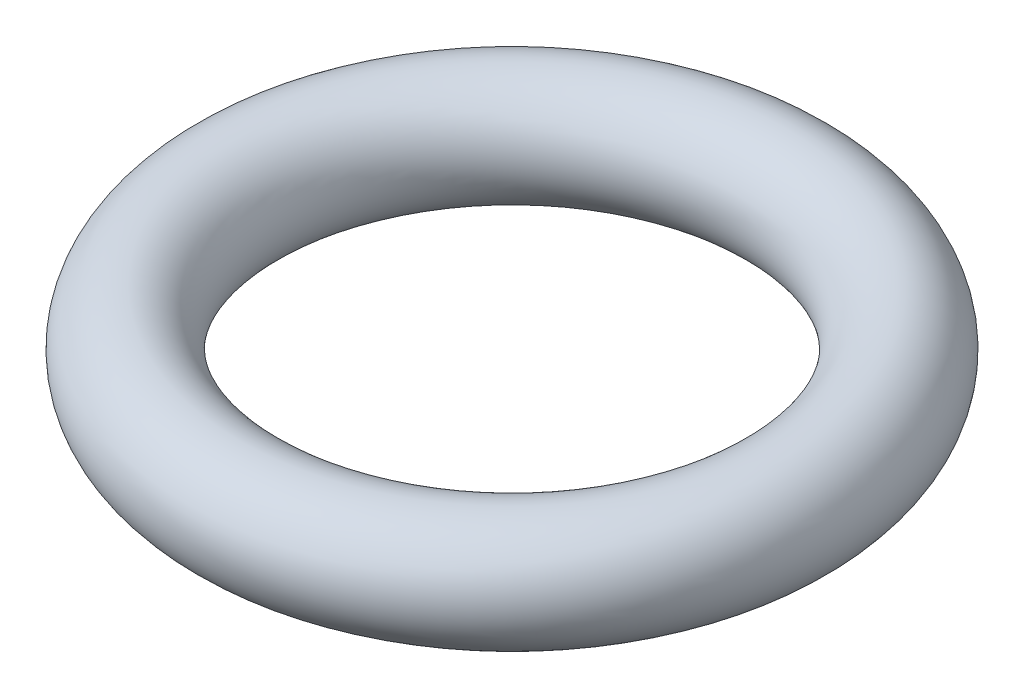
from build123d import *

# Parameters (mm, degrees)
ESQUISSE1_R = 0.85


with BuildPart() as part:
    # Esquisse1 → Base-R_volution (revolve)
    with BuildSketch(Plane.XY, mode=Mode.PRIVATE) as base_r_volution_sk:
        with Locations((-4.15, 0)):
            Circle(ESQUISSE1_R)
    revolve(base_r_volution_sk.sketch.rotate(Axis((0, 40, 0), (0, -1, 0)), 270), axis=Axis((0, 40, 0), (0, -1, 0)))


solid = part.part
